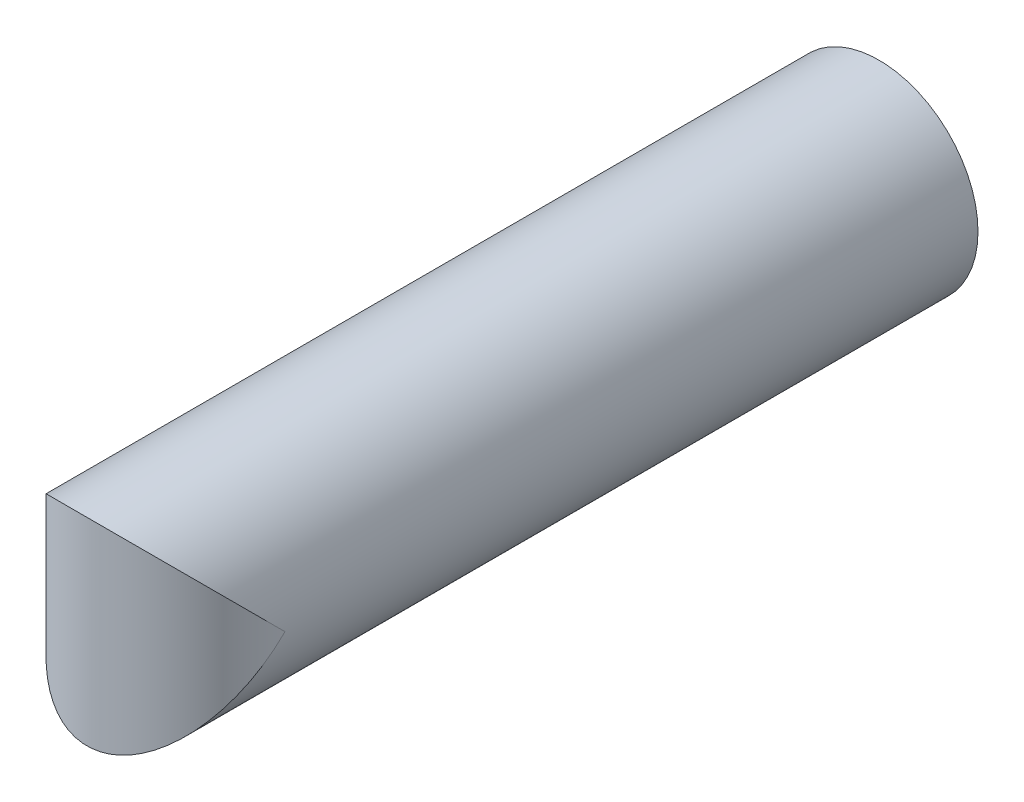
from build123d import *

# Parameters (mm, degrees)
ESQUISSE1_R                  = 2.5
BASE_EXTRUSION_DEPTH         = 20
ENL_V_MAT_EXTRU_1_DEPTH      = 21.310096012
ENL_V_MAT_EXTRU_1_DEPTH_BACK = 21.310096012


with BuildPart() as part:
    # Esquisse1 → Base-Extrusion (new body)
    with BuildSketch(Plane.XY):
        Circle(ESQUISSE1_R)
    extrude(amount=BASE_EXTRUSION_DEPTH)

    # Esquisse2 → Enl_v. mat.-Extru.1 (cut, two sides: drawn at the far end of the back side and taken through both)
    with BuildSketch(Plane(origin=(0, 0, 0), x_dir=(1, 0, 0), z_dir=(0, 1, 0)).offset(-ENL_V_MAT_EXTRU_1_DEPTH_BACK)):
        with BuildLine():
            Line((-2.5, -20.724734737), (2.5, -20.724734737))
            Line((2.5, -20.724734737), (2.5, -17.5))
            ThreePointArc((2.5, -17.5), (0, -20), (-2.5, -17.5))
            Line((-2.5, -17.5), (-2.5, -20.724734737))
        make_face()
    extrude(amount=ENL_V_MAT_EXTRU_1_DEPTH + ENL_V_MAT_EXTRU_1_DEPTH_BACK, mode=Mode.SUBTRACT)


solid = part.part
